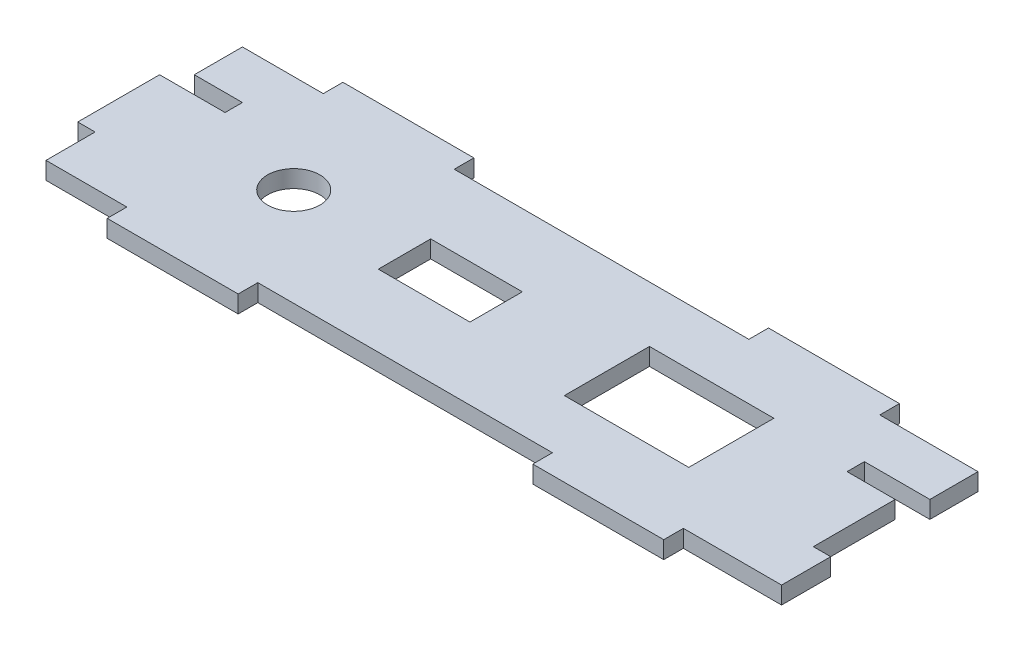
ISO-10303-21;
HEADER;
FILE_DESCRIPTION(('STEP AP214'),'2;1');
FILE_NAME('part.step','',(''),(''),'','','');
FILE_SCHEMA(('AUTOMOTIVE_DESIGN { 1 0 10303 214 1 1 1 1 }'));
ENDSEC;
DATA;
#1=APPLICATION_CONTEXT('core data for automotive mechanical design processes');
#2=APPLICATION_PROTOCOL_DEFINITION('international standard','automotive_design',2000,#1);
#3=PRODUCT_CONTEXT('',#1,'mechanical');
#4=PRODUCT('Part','Part','',(#3));
#5=PRODUCT_RELATED_PRODUCT_CATEGORY('part','',(#4));
#6=PRODUCT_DEFINITION_FORMATION('','',#4);
#7=PRODUCT_DEFINITION_CONTEXT('part definition',#1,'design');
#8=PRODUCT_DEFINITION('design','',#6,#7);
#9=PRODUCT_DEFINITION_SHAPE('','',#8);
#10=(LENGTH_UNIT() NAMED_UNIT(*) SI_UNIT(.MILLI.,.METRE.));
#11=(NAMED_UNIT(*) PLANE_ANGLE_UNIT() SI_UNIT($,.RADIAN.));
#12=(NAMED_UNIT(*) SI_UNIT($,.STERADIAN.) SOLID_ANGLE_UNIT());
#13=UNCERTAINTY_MEASURE_WITH_UNIT(LENGTH_MEASURE(1.E-05),#10,'distance_accuracy_value','');
#14=(GEOMETRIC_REPRESENTATION_CONTEXT(3) GLOBAL_UNCERTAINTY_ASSIGNED_CONTEXT((#13)) GLOBAL_UNIT_ASSIGNED_CONTEXT((#10,
#11,#12)) REPRESENTATION_CONTEXT('',''));
#15=CARTESIAN_POINT('',(0.,0.,0.));
#16=DIRECTION('',(0.,0.,1.));
#17=DIRECTION('',(1.,0.,0.));
#18=AXIS2_PLACEMENT_3D('',#15,#16,#17);
#19=CARTESIAN_POINT('',(0.,0.,30.));
#20=DIRECTION('',(0.,0.,1.));
#21=DIRECTION('',(1.,0.,0.));
#22=AXIS2_PLACEMENT_3D('',#19,#20,#21);
#23=PLANE('',#22);
#24=DIRECTION('',(0.,1.,0.));
#25=VECTOR('',#24,1.);
#26=CARTESIAN_POINT('',(85.,120.,30.));
#27=LINE('',#26,#25);
#28=CARTESIAN_POINT('',(85.,117.35,30.));
#29=VERTEX_POINT('',#28);
#30=CARTESIAN_POINT('',(85.,120.,30.));
#31=VERTEX_POINT('',#30);
#32=EDGE_CURVE('E407',#29,#31,#27,.T.);
#33=ORIENTED_EDGE('',*,*,#32,.T.);
#34=DIRECTION('',(-1.,0.,0.));
#35=VECTOR('',#34,1.);
#36=CARTESIAN_POINT('',(4.99999999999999,120.,30.));
#37=LINE('',#36,#35);
#38=CARTESIAN_POINT('',(40.,120.,30.));
#39=VERTEX_POINT('',#38);
#40=EDGE_CURVE('E565',#31,#39,#37,.T.);
#41=ORIENTED_EDGE('',*,*,#40,.T.);
#42=DIRECTION('',(0.,-1.,0.));
#43=VECTOR('',#42,1.);
#44=CARTESIAN_POINT('',(40.,120.,30.));
#45=LINE('',#44,#43);
#46=CARTESIAN_POINT('',(40.,117.35,30.));
#47=VERTEX_POINT('',#46);
#48=EDGE_CURVE('E441',#39,#47,#45,.T.);
#49=ORIENTED_EDGE('',*,*,#48,.T.);
#50=DIRECTION('',(1.,0.,0.));
#51=VECTOR('',#50,1.);
#52=CARTESIAN_POINT('',(4.99999999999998,117.35,30.));
#53=LINE('',#52,#51);
#54=EDGE_CURVE('E558',#47,#29,#53,.T.);
#55=ORIENTED_EDGE('',*,*,#54,.T.);
#56=EDGE_LOOP('',(#33,#41,#49,#55));
#57=FACE_BOUND('',#56,.T.);
#58=ADVANCED_FACE('F33',(#57),#23,.T.);
#59=CARTESIAN_POINT('',(7.64999999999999,117.35,30.));
#60=VERTEX_POINT('',#59);
#61=CARTESIAN_POINT('',(19.9999999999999,117.35,30.));
#62=VERTEX_POINT('',#61);
#63=EDGE_CURVE('E554',#60,#62,#53,.T.);
#64=ORIENTED_EDGE('',*,*,#63,.T.);
#65=DIRECTION('',(0.,1.,0.));
#66=VECTOR('',#65,1.);
#67=CARTESIAN_POINT('',(20.,120.,30.));
#68=LINE('',#67,#66);
#69=CARTESIAN_POINT('',(20.,120.,30.));
#70=VERTEX_POINT('',#69);
#71=EDGE_CURVE('E436',#62,#70,#68,.T.);
#72=ORIENTED_EDGE('',*,*,#71,.T.);
#73=CARTESIAN_POINT('',(7.64999999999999,120.,30.));
#74=VERTEX_POINT('',#73);
#75=EDGE_CURVE('E561',#70,#74,#37,.T.);
#76=ORIENTED_EDGE('',*,*,#75,.T.);
#77=DIRECTION('',(0.,1.,0.));
#78=VECTOR('',#77,1.);
#79=CARTESIAN_POINT('',(7.64999999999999,102.117715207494,30.));
#80=LINE('',#79,#78);
#81=EDGE_CURVE('E490',#60,#74,#80,.T.);
#82=ORIENTED_EDGE('',*,*,#81,.F.);
#83=EDGE_LOOP('',(#64,#72,#76,#82));
#84=FACE_BOUND('',#83,.T.);
#85=ADVANCED_FACE('F698',(#84),#23,.T.);
#86=DIRECTION('',(0.,-1.,0.));
#87=VECTOR('',#86,1.);
#88=CARTESIAN_POINT('',(105.,120.,30.));
#89=LINE('',#88,#87);
#90=CARTESIAN_POINT('',(105.,120.,30.));
#91=VERTEX_POINT('',#90);
#92=CARTESIAN_POINT('',(105.,117.35,30.));
#93=VERTEX_POINT('',#92);
#94=EDGE_CURVE('E412',#91,#93,#89,.T.);
#95=ORIENTED_EDGE('',*,*,#94,.T.);
#96=CARTESIAN_POINT('',(120.,117.35,30.));
#97=VERTEX_POINT('',#96);
#98=EDGE_CURVE('E559',#93,#97,#53,.T.);
#99=ORIENTED_EDGE('',*,*,#98,.T.);
#100=DIRECTION('',(0.,1.,0.));
#101=VECTOR('',#100,1.);
#102=CARTESIAN_POINT('',(120.,120.,30.));
#103=LINE('',#102,#101);
#104=CARTESIAN_POINT('',(120.,120.,30.));
#105=VERTEX_POINT('',#104);
#106=EDGE_CURVE('E557',#97,#105,#103,.T.);
#107=ORIENTED_EDGE('',*,*,#106,.T.);
#108=EDGE_CURVE('E562',#105,#91,#37,.T.);
#109=ORIENTED_EDGE('',*,*,#108,.T.);
#110=EDGE_LOOP('',(#95,#99,#107,#109));
#111=FACE_BOUND('',#110,.T.);
#112=ADVANCED_FACE('F726',(#111),#23,.T.);
#113=CARTESIAN_POINT('',(120.,120.,30.));
#114=DIRECTION('',(-1.,0.,0.));
#115=DIRECTION('',(0.,0.,1.));
#116=AXIS2_PLACEMENT_3D('',#113,#114,#115);
#117=PLANE('',#116);
#118=DIRECTION('',(0.,0.,-1.));
#119=VECTOR('',#118,1.);
#120=CARTESIAN_POINT('',(120.,117.35,30.));
#121=LINE('',#120,#119);
#122=CARTESIAN_POINT('',(120.,117.35,22.5));
#123=VERTEX_POINT('',#122);
#124=EDGE_CURVE('E584',#97,#123,#121,.T.);
#125=ORIENTED_EDGE('',*,*,#124,.T.);
#126=DIRECTION('',(0.,1.,0.));
#127=VECTOR('',#126,1.);
#128=CARTESIAN_POINT('',(120.,102.117715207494,22.5));
#129=LINE('',#128,#127);
#130=CARTESIAN_POINT('',(120.,120.,22.5));
#131=VERTEX_POINT('',#130);
#132=EDGE_CURVE('E468',#123,#131,#129,.T.);
#133=ORIENTED_EDGE('',*,*,#132,.T.);
#134=DIRECTION('',(0.,0.,-1.));
#135=VECTOR('',#134,1.);
#136=CARTESIAN_POINT('',(120.,120.,30.));
#137=LINE('',#136,#135);
#138=EDGE_CURVE('E580',#105,#131,#137,.T.);
#139=ORIENTED_EDGE('',*,*,#138,.F.);
#140=ORIENTED_EDGE('',*,*,#106,.F.);
#141=EDGE_LOOP('',(#125,#133,#139,#140));
#142=FACE_BOUND('',#141,.T.);
#143=ADVANCED_FACE('F608',(#142),#117,.F.);
#144=CARTESIAN_POINT('',(0.,0.,0.));
#145=DIRECTION('',(0.,0.,1.));
#146=DIRECTION('',(1.,0.,0.));
#147=AXIS2_PLACEMENT_3D('',#144,#145,#146);
#148=PLANE('',#147);
#149=DIRECTION('',(0.,-1.,0.));
#150=VECTOR('',#149,1.);
#151=CARTESIAN_POINT('',(105.,120.,0.));
#152=LINE('',#151,#150);
#153=CARTESIAN_POINT('',(105.,120.,0.));
#154=VERTEX_POINT('',#153);
#155=CARTESIAN_POINT('',(105.,117.35,0.));
#156=VERTEX_POINT('',#155);
#157=EDGE_CURVE('E470',#154,#156,#152,.T.);
#158=ORIENTED_EDGE('',*,*,#157,.F.);
#159=DIRECTION('',(-1.,0.,0.));
#160=VECTOR('',#159,1.);
#161=CARTESIAN_POINT('',(4.99999999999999,120.,0.));
#162=LINE('',#161,#160);
#163=CARTESIAN_POINT('',(120.,120.,0.));
#164=VERTEX_POINT('',#163);
#165=EDGE_CURVE('E573',#164,#154,#162,.T.);
#166=ORIENTED_EDGE('',*,*,#165,.F.);
#167=DIRECTION('',(0.,1.,0.));
#168=VECTOR('',#167,1.);
#169=CARTESIAN_POINT('',(120.,120.,0.));
#170=LINE('',#169,#168);
#171=CARTESIAN_POINT('',(120.,117.35,0.));
#172=VERTEX_POINT('',#171);
#173=EDGE_CURVE('E568',#172,#164,#170,.T.);
#174=ORIENTED_EDGE('',*,*,#173,.F.);
#175=DIRECTION('',(1.,0.,0.));
#176=VECTOR('',#175,1.);
#177=CARTESIAN_POINT('',(4.99999999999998,117.35,0.));
#178=LINE('',#177,#176);
#179=EDGE_CURVE('E553',#156,#172,#178,.T.);
#180=ORIENTED_EDGE('',*,*,#179,.F.);
#181=EDGE_LOOP('',(#158,#166,#174,#180));
#182=FACE_BOUND('',#181,.T.);
#183=ADVANCED_FACE('F631',(#182),#148,.F.);
#184=DIRECTION('',(0.,1.,0.));
#185=VECTOR('',#184,1.);
#186=CARTESIAN_POINT('',(85.,120.,0.));
#187=LINE('',#186,#185);
#188=CARTESIAN_POINT('',(85.,117.35,0.));
#189=VERTEX_POINT('',#188);
#190=CARTESIAN_POINT('',(85.,120.,0.));
#191=VERTEX_POINT('',#190);
#192=EDGE_CURVE('E508',#189,#191,#187,.T.);
#193=ORIENTED_EDGE('',*,*,#192,.F.);
#194=CARTESIAN_POINT('',(39.9999999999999,117.35,0.));
#195=VERTEX_POINT('',#194);
#196=EDGE_CURVE('E569',#195,#189,#178,.T.);
#197=ORIENTED_EDGE('',*,*,#196,.F.);
#198=DIRECTION('',(0.,-1.,0.));
#199=VECTOR('',#198,1.);
#200=CARTESIAN_POINT('',(40.,120.,0.));
#201=LINE('',#200,#199);
#202=CARTESIAN_POINT('',(40.,120.,0.));
#203=VERTEX_POINT('',#202);
#204=EDGE_CURVE('E531',#203,#195,#201,.T.);
#205=ORIENTED_EDGE('',*,*,#204,.F.);
#206=EDGE_CURVE('E576',#191,#203,#162,.T.);
#207=ORIENTED_EDGE('',*,*,#206,.F.);
#208=EDGE_LOOP('',(#193,#197,#205,#207));
#209=FACE_BOUND('',#208,.T.);
#210=ADVANCED_FACE('F651',(#209),#148,.F.);
#211=CARTESIAN_POINT('',(7.64999999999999,117.35,0.));
#212=VERTEX_POINT('',#211);
#213=CARTESIAN_POINT('',(20.,117.35,0.));
#214=VERTEX_POINT('',#213);
#215=EDGE_CURVE('E566',#212,#214,#178,.T.);
#216=ORIENTED_EDGE('',*,*,#215,.F.);
#217=DIRECTION('',(0.,1.,0.));
#218=VECTOR('',#217,1.);
#219=CARTESIAN_POINT('',(7.65,102.117715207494,0.));
#220=LINE('',#219,#218);
#221=CARTESIAN_POINT('',(7.64999999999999,120.,0.));
#222=VERTEX_POINT('',#221);
#223=EDGE_CURVE('E500',#212,#222,#220,.T.);
#224=ORIENTED_EDGE('',*,*,#223,.T.);
#225=CARTESIAN_POINT('',(20.,120.,0.));
#226=VERTEX_POINT('',#225);
#227=EDGE_CURVE('E572',#226,#222,#162,.T.);
#228=ORIENTED_EDGE('',*,*,#227,.F.);
#229=DIRECTION('',(0.,1.,0.));
#230=VECTOR('',#229,1.);
#231=CARTESIAN_POINT('',(20.,120.,0.));
#232=LINE('',#231,#230);
#233=EDGE_CURVE('E526',#214,#226,#232,.T.);
#234=ORIENTED_EDGE('',*,*,#233,.F.);
#235=EDGE_LOOP('',(#216,#224,#228,#234));
#236=FACE_BOUND('',#235,.T.);
#237=ADVANCED_FACE('F668',(#236),#148,.F.);
#238=CARTESIAN_POINT('',(4.99999999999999,120.,30.));
#239=DIRECTION('',(1.,0.,0.));
#240=DIRECTION('',(0.,1.,0.));
#241=AXIS2_PLACEMENT_3D('',#238,#239,#240);
#242=PLANE('',#241);
#243=DIRECTION('',(0.,0.,-1.));
#244=VECTOR('',#243,1.);
#245=CARTESIAN_POINT('',(4.99999999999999,120.,30.));
#246=LINE('',#245,#244);
#247=CARTESIAN_POINT('',(4.99999999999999,120.,22.5));
#248=VERTEX_POINT('',#247);
#249=CARTESIAN_POINT('',(4.99999999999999,120.,10.));
#250=VERTEX_POINT('',#249);
#251=EDGE_CURVE('E564',#248,#250,#246,.T.);
#252=ORIENTED_EDGE('',*,*,#251,.T.);
#253=DIRECTION('',(0.,1.,0.));
#254=VECTOR('',#253,1.);
#255=CARTESIAN_POINT('',(4.99999999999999,117.,10.));
#256=LINE('',#255,#254);
#257=CARTESIAN_POINT('',(4.99999999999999,117.35,10.));
#258=VERTEX_POINT('',#257);
#259=EDGE_CURVE('E371',#258,#250,#256,.T.);
#260=ORIENTED_EDGE('',*,*,#259,.F.);
#261=DIRECTION('',(0.,0.,-1.));
#262=VECTOR('',#261,1.);
#263=CARTESIAN_POINT('',(4.99999999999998,117.35,30.));
#264=LINE('',#263,#262);
#265=CARTESIAN_POINT('',(4.99999999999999,117.35,22.5));
#266=VERTEX_POINT('',#265);
#267=EDGE_CURVE('E587',#266,#258,#264,.T.);
#268=ORIENTED_EDGE('',*,*,#267,.F.);
#269=DIRECTION('',(0.,1.,0.));
#270=VECTOR('',#269,1.);
#271=CARTESIAN_POINT('',(4.99999999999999,102.117715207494,22.5));
#272=LINE('',#271,#270);
#273=EDGE_CURVE('E483',#266,#248,#272,.T.);
#274=ORIENTED_EDGE('',*,*,#273,.T.);
#275=EDGE_LOOP('',(#252,#260,#268,#274));
#276=FACE_BOUND('',#275,.T.);
#277=ADVANCED_FACE('F35',(#276),#242,.F.);
#278=CARTESIAN_POINT('',(4.99999999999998,117.35,30.));
#279=DIRECTION('',(0.,1.,0.));
#280=DIRECTION('',(0.,0.,1.));
#281=AXIS2_PLACEMENT_3D('',#278,#279,#280);
#282=PLANE('',#281);
#283=DIRECTION('',(1.,0.,0.));
#284=VECTOR('',#283,1.);
#285=CARTESIAN_POINT('',(61.4182559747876,117.35,11.0142598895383));
#286=LINE('',#285,#284);
#287=CARTESIAN_POINT('',(47.4182559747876,117.35,11.0142598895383));
#288=VERTEX_POINT('',#287);
#289=CARTESIAN_POINT('',(61.4182559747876,117.35,11.0142598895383));
#290=VERTEX_POINT('',#289);
#291=EDGE_CURVE('E310',#288,#290,#286,.T.);
#292=ORIENTED_EDGE('',*,*,#291,.F.);
#293=DIRECTION('',(0.,0.,-1.));
#294=VECTOR('',#293,1.);
#295=CARTESIAN_POINT('',(47.4182559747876,117.35,19.0142598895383));
#296=LINE('',#295,#294);
#297=CARTESIAN_POINT('',(47.4182559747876,117.35,19.0142598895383));
#298=VERTEX_POINT('',#297);
#299=EDGE_CURVE('E292',#298,#288,#296,.T.);
#300=ORIENTED_EDGE('',*,*,#299,.F.);
#301=DIRECTION('',(-1.,0.,0.));
#302=VECTOR('',#301,1.);
#303=CARTESIAN_POINT('',(61.4182559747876,117.35,19.0142598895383));
#304=LINE('',#303,#302);
#305=CARTESIAN_POINT('',(61.4182559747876,117.35,19.0142598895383));
#306=VERTEX_POINT('',#305);
#307=EDGE_CURVE('E301',#306,#298,#304,.T.);
#308=ORIENTED_EDGE('',*,*,#307,.F.);
#309=DIRECTION('',(0.,0.,1.));
#310=VECTOR('',#309,1.);
#311=CARTESIAN_POINT('',(61.4182559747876,117.35,19.0142598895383));
#312=LINE('',#311,#310);
#313=EDGE_CURVE('E48',#290,#306,#312,.T.);
#314=ORIENTED_EDGE('',*,*,#313,.F.);
#315=EDGE_LOOP('',(#292,#300,#308,#314));
#316=FACE_BOUND('',#315,.T.);
#317=CARTESIAN_POINT('',(30.4865119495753,117.35,14.9999999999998));
#318=DIRECTION('',(0.,1.,0.));
#319=DIRECTION('',(0.,0.,1.));
#320=AXIS2_PLACEMENT_3D('',#317,#318,#319);
#321=CIRCLE('',#320,4.00000000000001);
#322=CARTESIAN_POINT('',(30.4865119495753,117.35,18.9999999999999));
#323=VERTEX_POINT('',#322);
#324=EDGE_CURVE('E329',#323,#323,#321,.F.);
#325=ORIENTED_EDGE('',*,*,#324,.F.);
#326=EDGE_LOOP('',(#325));
#327=FACE_BOUND('',#326,.T.);
#328=DIRECTION('',(1.,0.,0.));
#329=VECTOR('',#328,1.);
#330=CARTESIAN_POINT('',(78.35,117.35,8.52851977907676));
#331=LINE('',#330,#329);
#332=CARTESIAN_POINT('',(78.35,117.35,8.52851977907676));
#333=VERTEX_POINT('',#332);
#334=CARTESIAN_POINT('',(97.35,117.35,8.52851977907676));
#335=VERTEX_POINT('',#334);
#336=EDGE_CURVE('E336',#333,#335,#331,.T.);
#337=ORIENTED_EDGE('',*,*,#336,.F.);
#338=DIRECTION('',(0.,0.,-1.));
#339=VECTOR('',#338,1.);
#340=CARTESIAN_POINT('',(78.35,117.35,8.52851977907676));
#341=LINE('',#340,#339);
#342=CARTESIAN_POINT('',(78.35,117.35,21.5285197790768));
#343=VERTEX_POINT('',#342);
#344=EDGE_CURVE('E339',#343,#333,#341,.T.);
#345=ORIENTED_EDGE('',*,*,#344,.F.);
#346=DIRECTION('',(-1.,0.,0.));
#347=VECTOR('',#346,1.);
#348=CARTESIAN_POINT('',(78.35,117.35,21.5285197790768));
#349=LINE('',#348,#347);
#350=CARTESIAN_POINT('',(97.35,117.35,21.5285197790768));
#351=VERTEX_POINT('',#350);
#352=EDGE_CURVE('E341',#351,#343,#349,.T.);
#353=ORIENTED_EDGE('',*,*,#352,.F.);
#354=DIRECTION('',(0.,0.,1.));
#355=VECTOR('',#354,1.);
#356=CARTESIAN_POINT('',(97.35,117.35,8.52851977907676));
#357=LINE('',#356,#355);
#358=EDGE_CURVE('E333',#335,#351,#357,.T.);
#359=ORIENTED_EDGE('',*,*,#358,.F.);
#360=EDGE_LOOP('',(#337,#345,#353,#359));
#361=FACE_BOUND('',#360,.T.);
#362=DIRECTION('',(0.,0.,-1.));
#363=VECTOR('',#362,1.);
#364=CARTESIAN_POINT('',(15.,117.35,30.));
#365=LINE('',#364,#363);
#366=CARTESIAN_POINT('',(15.,117.35,10.));
#367=VERTEX_POINT('',#366);
#368=CARTESIAN_POINT('',(15.,117.35,7.35));
#369=VERTEX_POINT('',#368);
#370=EDGE_CURVE('E404',#367,#369,#365,.T.);
#371=ORIENTED_EDGE('',*,*,#370,.T.);
#372=DIRECTION('',(-1.,0.,0.));
#373=VECTOR('',#372,1.);
#374=CARTESIAN_POINT('',(4.99999999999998,117.35,7.35));
#375=LINE('',#374,#373);
#376=CARTESIAN_POINT('',(7.64999999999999,117.35,7.35));
#377=VERTEX_POINT('',#376);
#378=EDGE_CURVE('E392',#369,#377,#375,.T.);
#379=ORIENTED_EDGE('',*,*,#378,.T.);
#380=DIRECTION('',(0.,0.,1.));
#381=VECTOR('',#380,1.);
#382=CARTESIAN_POINT('',(7.64999999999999,117.35,7.50000000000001));
#383=LINE('',#382,#381);
#384=EDGE_CURVE('E488',#212,#377,#383,.T.);
#385=ORIENTED_EDGE('',*,*,#384,.F.);
#386=ORIENTED_EDGE('',*,*,#215,.T.);
#387=DIRECTION('',(0.,0.,1.));
#388=VECTOR('',#387,1.);
#389=CARTESIAN_POINT('',(19.9999999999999,117.35,-3.));
#390=LINE('',#389,#388);
#391=CARTESIAN_POINT('',(19.9999999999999,117.35,-3.));
#392=VERTEX_POINT('',#391);
#393=EDGE_CURVE('E537',#392,#214,#390,.T.);
#394=ORIENTED_EDGE('',*,*,#393,.F.);
#395=DIRECTION('',(-1.,0.,0.));
#396=VECTOR('',#395,1.);
#397=CARTESIAN_POINT('',(19.9999999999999,117.35,-3.));
#398=LINE('',#397,#396);
#399=CARTESIAN_POINT('',(39.9999999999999,117.35,-3.));
#400=VERTEX_POINT('',#399);
#401=EDGE_CURVE('E535',#400,#392,#398,.T.);
#402=ORIENTED_EDGE('',*,*,#401,.F.);
#403=DIRECTION('',(0.,0.,1.));
#404=VECTOR('',#403,1.);
#405=CARTESIAN_POINT('',(39.9999999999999,117.35,-3.));
#406=LINE('',#405,#404);
#407=EDGE_CURVE('E544',#400,#195,#406,.T.);
#408=ORIENTED_EDGE('',*,*,#407,.T.);
#409=ORIENTED_EDGE('',*,*,#196,.T.);
#410=DIRECTION('',(0.,0.,1.));
#411=VECTOR('',#410,1.);
#412=CARTESIAN_POINT('',(85.,117.35,-3.));
#413=LINE('',#412,#411);
#414=CARTESIAN_POINT('',(85.,117.35,-3.));
#415=VERTEX_POINT('',#414);
#416=EDGE_CURVE('E519',#415,#189,#413,.T.);
#417=ORIENTED_EDGE('',*,*,#416,.F.);
#418=DIRECTION('',(-1.,0.,0.));
#419=VECTOR('',#418,1.);
#420=CARTESIAN_POINT('',(105.,117.35,-3.));
#421=LINE('',#420,#419);
#422=CARTESIAN_POINT('',(105.,117.35,-3.));
#423=VERTEX_POINT('',#422);
#424=EDGE_CURVE('E510',#423,#415,#421,.T.);
#425=ORIENTED_EDGE('',*,*,#424,.F.);
#426=DIRECTION('',(0.,0.,1.));
#427=VECTOR('',#426,1.);
#428=CARTESIAN_POINT('',(105.,117.35,-3.));
#429=LINE('',#428,#427);
#430=EDGE_CURVE('E521',#423,#156,#429,.T.);
#431=ORIENTED_EDGE('',*,*,#430,.T.);
#432=ORIENTED_EDGE('',*,*,#179,.T.);
#433=CARTESIAN_POINT('',(120.,117.35,7.34999999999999));
#434=VERTEX_POINT('',#433);
#435=EDGE_CURVE('E583',#434,#172,#121,.T.);
#436=ORIENTED_EDGE('',*,*,#435,.F.);
#437=DIRECTION('',(-1.,0.,0.));
#438=VECTOR('',#437,1.);
#439=CARTESIAN_POINT('',(4.99999999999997,117.35,7.35000000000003));
#440=LINE('',#439,#438);
#441=CARTESIAN_POINT('',(110.,117.35,7.34999999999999));
#442=VERTEX_POINT('',#441);
#443=EDGE_CURVE('E398',#434,#442,#440,.T.);
#444=ORIENTED_EDGE('',*,*,#443,.T.);
#445=DIRECTION('',(0.,0.,1.));
#446=VECTOR('',#445,1.);
#447=CARTESIAN_POINT('',(110.,117.35,30.));
#448=LINE('',#447,#446);
#449=CARTESIAN_POINT('',(110.,117.35,9.99999999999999));
#450=VERTEX_POINT('',#449);
#451=EDGE_CURVE('E395',#442,#450,#448,.T.);
#452=ORIENTED_EDGE('',*,*,#451,.T.);
#453=DIRECTION('',(1.,0.,0.));
#454=VECTOR('',#453,1.);
#455=CARTESIAN_POINT('',(4.99999999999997,117.35,10.));
#456=LINE('',#455,#454);
#457=CARTESIAN_POINT('',(117.35,117.35,9.99999999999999));
#458=VERTEX_POINT('',#457);
#459=EDGE_CURVE('E374',#450,#458,#456,.T.);
#460=ORIENTED_EDGE('',*,*,#459,.T.);
#461=DIRECTION('',(0.,0.,-1.));
#462=VECTOR('',#461,1.);
#463=CARTESIAN_POINT('',(117.35,117.35,7.5));
#464=LINE('',#463,#462);
#465=CARTESIAN_POINT('',(117.35,117.35,22.5));
#466=VERTEX_POINT('',#465);
#467=EDGE_CURVE('E464',#466,#458,#464,.T.);
#468=ORIENTED_EDGE('',*,*,#467,.F.);
#469=DIRECTION('',(-1.,0.,0.));
#470=VECTOR('',#469,1.);
#471=CARTESIAN_POINT('',(120.,117.35,22.5));
#472=LINE('',#471,#470);
#473=EDGE_CURVE('E467',#123,#466,#472,.T.);
#474=ORIENTED_EDGE('',*,*,#473,.F.);
#475=ORIENTED_EDGE('',*,*,#124,.F.);
#476=ORIENTED_EDGE('',*,*,#98,.F.);
#477=DIRECTION('',(0.,0.,-1.));
#478=VECTOR('',#477,1.);
#479=CARTESIAN_POINT('',(105.,117.35,33.));
#480=LINE('',#479,#478);
#481=CARTESIAN_POINT('',(105.,117.35,33.));
#482=VERTEX_POINT('',#481);
#483=EDGE_CURVE('E427',#482,#93,#480,.T.);
#484=ORIENTED_EDGE('',*,*,#483,.F.);
#485=DIRECTION('',(-1.,0.,0.));
#486=VECTOR('',#485,1.);
#487=CARTESIAN_POINT('',(105.,117.35,33.));
#488=LINE('',#487,#486);
#489=CARTESIAN_POINT('',(85.,117.35,33.));
#490=VERTEX_POINT('',#489);
#491=EDGE_CURVE('E415',#482,#490,#488,.T.);
#492=ORIENTED_EDGE('',*,*,#491,.T.);
#493=DIRECTION('',(0.,0.,-1.));
#494=VECTOR('',#493,1.);
#495=CARTESIAN_POINT('',(85.,117.35,33.));
#496=LINE('',#495,#494);
#497=EDGE_CURVE('E430',#490,#29,#496,.T.);
#498=ORIENTED_EDGE('',*,*,#497,.T.);
#499=ORIENTED_EDGE('',*,*,#54,.F.);
#500=DIRECTION('',(0.,0.,-1.));
#501=VECTOR('',#500,1.);
#502=CARTESIAN_POINT('',(39.9999999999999,117.35,33.));
#503=LINE('',#502,#501);
#504=CARTESIAN_POINT('',(39.9999999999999,117.35,33.));
#505=VERTEX_POINT('',#504);
#506=EDGE_CURVE('E459',#505,#47,#503,.T.);
#507=ORIENTED_EDGE('',*,*,#506,.F.);
#508=DIRECTION('',(-1.,0.,0.));
#509=VECTOR('',#508,1.);
#510=CARTESIAN_POINT('',(19.9999999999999,117.35,33.));
#511=LINE('',#510,#509);
#512=CARTESIAN_POINT('',(19.9999999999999,117.35,33.));
#513=VERTEX_POINT('',#512);
#514=EDGE_CURVE('E440',#505,#513,#511,.T.);
#515=ORIENTED_EDGE('',*,*,#514,.T.);
#516=DIRECTION('',(0.,0.,-1.));
#517=VECTOR('',#516,1.);
#518=CARTESIAN_POINT('',(19.9999999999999,117.35,33.));
#519=LINE('',#518,#517);
#520=EDGE_CURVE('E461',#513,#62,#519,.T.);
#521=ORIENTED_EDGE('',*,*,#520,.T.);
#522=ORIENTED_EDGE('',*,*,#63,.F.);
#523=DIRECTION('',(0.,0.,1.));
#524=VECTOR('',#523,1.);
#525=CARTESIAN_POINT('',(7.64999999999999,117.35,30.));
#526=LINE('',#525,#524);
#527=CARTESIAN_POINT('',(7.64999999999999,117.35,22.5));
#528=VERTEX_POINT('',#527);
#529=EDGE_CURVE('E474',#528,#60,#526,.T.);
#530=ORIENTED_EDGE('',*,*,#529,.F.);
#531=DIRECTION('',(1.,0.,0.));
#532=VECTOR('',#531,1.);
#533=CARTESIAN_POINT('',(7.64999999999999,117.35,22.5));
#534=LINE('',#533,#532);
#535=EDGE_CURVE('E481',#266,#528,#534,.T.);
#536=ORIENTED_EDGE('',*,*,#535,.F.);
#537=ORIENTED_EDGE('',*,*,#267,.T.);
#538=DIRECTION('',(1.,0.,0.));
#539=VECTOR('',#538,1.);
#540=CARTESIAN_POINT('',(4.99999999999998,117.35,10.));
#541=LINE('',#540,#539);
#542=EDGE_CURVE('E401',#258,#367,#541,.T.);
#543=ORIENTED_EDGE('',*,*,#542,.T.);
#544=EDGE_LOOP('',(#371,#379,#385,#386,#394,#402,#408,#409,#417,#425,#431,#432,#436,#444,#452,
#460,#468,#474,#475,#476,#484,#492,#498,#499,#507,#515,#521,#522,#530,#536,#537,#543));
#545=FACE_BOUND('',#544,.T.);
#546=ADVANCED_FACE('F307',(#316,#327,#361,#545),#282,.F.);
#547=CARTESIAN_POINT('',(120.,120.,7.34999999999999));
#548=VERTEX_POINT('',#547);
#549=EDGE_CURVE('E579',#548,#164,#137,.T.);
#550=ORIENTED_EDGE('',*,*,#549,.F.);
#551=DIRECTION('',(0.,1.,0.));
#552=VECTOR('',#551,1.);
#553=CARTESIAN_POINT('',(120.,117.,7.34999999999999));
#554=LINE('',#553,#552);
#555=EDGE_CURVE('E366',#434,#548,#554,.T.);
#556=ORIENTED_EDGE('',*,*,#555,.F.);
#557=ORIENTED_EDGE('',*,*,#435,.T.);
#558=ORIENTED_EDGE('',*,*,#173,.T.);
#559=EDGE_LOOP('',(#550,#556,#557,#558));
#560=FACE_BOUND('',#559,.T.);
#561=ADVANCED_FACE('F623',(#560),#117,.F.);
#562=CARTESIAN_POINT('',(4.99999999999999,120.,30.));
#563=DIRECTION('',(0.,-1.,0.));
#564=DIRECTION('',(1.,0.,0.));
#565=AXIS2_PLACEMENT_3D('',#562,#563,#564);
#566=PLANE('',#565);
#567=DIRECTION('',(1.,0.,0.));
#568=VECTOR('',#567,1.);
#569=CARTESIAN_POINT('',(61.4182559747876,120.,19.0142598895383));
#570=LINE('',#569,#568);
#571=CARTESIAN_POINT('',(47.4182559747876,120.,19.0142598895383));
#572=VERTEX_POINT('',#571);
#573=CARTESIAN_POINT('',(61.4182559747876,120.,19.0142598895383));
#574=VERTEX_POINT('',#573);
#575=EDGE_CURVE('E312',#572,#574,#570,.T.);
#576=ORIENTED_EDGE('',*,*,#575,.F.);
#577=DIRECTION('',(0.,0.,1.));
#578=VECTOR('',#577,1.);
#579=CARTESIAN_POINT('',(47.4182559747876,120.,19.0142598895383));
#580=LINE('',#579,#578);
#581=CARTESIAN_POINT('',(47.4182559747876,120.,11.0142598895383));
#582=VERTEX_POINT('',#581);
#583=EDGE_CURVE('E56',#582,#572,#580,.T.);
#584=ORIENTED_EDGE('',*,*,#583,.F.);
#585=DIRECTION('',(-1.,0.,0.));
#586=VECTOR('',#585,1.);
#587=CARTESIAN_POINT('',(61.4182559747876,120.,11.0142598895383));
#588=LINE('',#587,#586);
#589=CARTESIAN_POINT('',(61.4182559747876,120.,11.0142598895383));
#590=VERTEX_POINT('',#589);
#591=EDGE_CURVE('E298',#590,#582,#588,.T.);
#592=ORIENTED_EDGE('',*,*,#591,.F.);
#593=DIRECTION('',(0.,0.,-1.));
#594=VECTOR('',#593,1.);
#595=CARTESIAN_POINT('',(61.4182559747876,120.,19.0142598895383));
#596=LINE('',#595,#594);
#597=EDGE_CURVE('E318',#574,#590,#596,.T.);
#598=ORIENTED_EDGE('',*,*,#597,.F.);
#599=EDGE_LOOP('',(#576,#584,#592,#598));
#600=FACE_BOUND('',#599,.T.);
#601=CARTESIAN_POINT('',(30.4865119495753,120.,14.9999999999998));
#602=DIRECTION('',(0.,1.,0.));
#603=DIRECTION('',(-1.,0.,0.));
#604=AXIS2_PLACEMENT_3D('',#601,#602,#603);
#605=CIRCLE('',#604,4.00000000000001);
#606=CARTESIAN_POINT('',(26.4865119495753,120.,14.9999999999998));
#607=VERTEX_POINT('',#606);
#608=EDGE_CURVE('E304',#607,#607,#605,.T.);
#609=ORIENTED_EDGE('',*,*,#608,.F.);
#610=EDGE_LOOP('',(#609));
#611=FACE_BOUND('',#610,.T.);
#612=DIRECTION('',(1.,0.,0.));
#613=VECTOR('',#612,1.);
#614=CARTESIAN_POINT('',(78.35,120.,21.5285197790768));
#615=LINE('',#614,#613);
#616=CARTESIAN_POINT('',(78.35,120.,21.5285197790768));
#617=VERTEX_POINT('',#616);
#618=CARTESIAN_POINT('',(97.35,120.,21.5285197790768));
#619=VERTEX_POINT('',#618);
#620=EDGE_CURVE('E343',#617,#619,#615,.T.);
#621=ORIENTED_EDGE('',*,*,#620,.F.);
#622=DIRECTION('',(0.,0.,1.));
#623=VECTOR('',#622,1.);
#624=CARTESIAN_POINT('',(78.35,120.,8.52851977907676));
#625=LINE('',#624,#623);
#626=CARTESIAN_POINT('',(78.35,120.,8.52851977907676));
#627=VERTEX_POINT('',#626);
#628=EDGE_CURVE('E332',#627,#617,#625,.T.);
#629=ORIENTED_EDGE('',*,*,#628,.F.);
#630=DIRECTION('',(-1.,0.,0.));
#631=VECTOR('',#630,1.);
#632=CARTESIAN_POINT('',(78.35,120.,8.52851977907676));
#633=LINE('',#632,#631);
#634=CARTESIAN_POINT('',(97.35,120.,8.52851977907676));
#635=VERTEX_POINT('',#634);
#636=EDGE_CURVE('E349',#635,#627,#633,.T.);
#637=ORIENTED_EDGE('',*,*,#636,.F.);
#638=DIRECTION('',(0.,0.,-1.));
#639=VECTOR('',#638,1.);
#640=CARTESIAN_POINT('',(97.35,120.,8.52851977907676));
#641=LINE('',#640,#639);
#642=EDGE_CURVE('E346',#619,#635,#641,.T.);
#643=ORIENTED_EDGE('',*,*,#642,.F.);
#644=EDGE_LOOP('',(#621,#629,#637,#643));
#645=FACE_BOUND('',#644,.T.);
#646=DIRECTION('',(0.,0.,-1.));
#647=VECTOR('',#646,1.);
#648=CARTESIAN_POINT('',(7.64999999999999,120.,7.50000000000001));
#649=LINE('',#648,#647);
#650=CARTESIAN_POINT('',(7.64999999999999,120.,7.35));
#651=VERTEX_POINT('',#650);
#652=EDGE_CURVE('E463',#651,#222,#649,.T.);
#653=ORIENTED_EDGE('',*,*,#652,.F.);
#654=DIRECTION('',(-1.,0.,0.));
#655=VECTOR('',#654,1.);
#656=CARTESIAN_POINT('',(4.99999999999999,120.,7.35));
#657=LINE('',#656,#655);
#658=CARTESIAN_POINT('',(15.,120.,7.35));
#659=VERTEX_POINT('',#658);
#660=EDGE_CURVE('E369',#659,#651,#657,.T.);
#661=ORIENTED_EDGE('',*,*,#660,.F.);
#662=DIRECTION('',(0.,0.,-1.));
#663=VECTOR('',#662,1.);
#664=CARTESIAN_POINT('',(15.,120.,7.35));
#665=LINE('',#664,#663);
#666=CARTESIAN_POINT('',(15.,120.,10.));
#667=VERTEX_POINT('',#666);
#668=EDGE_CURVE('E365',#667,#659,#665,.T.);
#669=ORIENTED_EDGE('',*,*,#668,.F.);
#670=DIRECTION('',(1.,0.,0.));
#671=VECTOR('',#670,1.);
#672=CARTESIAN_POINT('',(4.99999999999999,120.,10.));
#673=LINE('',#672,#671);
#674=EDGE_CURVE('E362',#250,#667,#673,.T.);
#675=ORIENTED_EDGE('',*,*,#674,.F.);
#676=ORIENTED_EDGE('',*,*,#251,.F.);
#677=DIRECTION('',(-1.,0.,0.));
#678=VECTOR('',#677,1.);
#679=CARTESIAN_POINT('',(7.64999999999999,120.,22.5));
#680=LINE('',#679,#678);
#681=CARTESIAN_POINT('',(7.64999999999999,120.,22.5));
#682=VERTEX_POINT('',#681);
#683=EDGE_CURVE('E487',#682,#248,#680,.T.);
#684=ORIENTED_EDGE('',*,*,#683,.F.);
#685=DIRECTION('',(0.,0.,-1.));
#686=VECTOR('',#685,1.);
#687=CARTESIAN_POINT('',(7.64999999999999,120.,30.));
#688=LINE('',#687,#686);
#689=EDGE_CURVE('E484',#74,#682,#688,.T.);
#690=ORIENTED_EDGE('',*,*,#689,.F.);
#691=ORIENTED_EDGE('',*,*,#75,.F.);
#692=DIRECTION('',(0.,0.,-1.));
#693=VECTOR('',#692,1.);
#694=CARTESIAN_POINT('',(20.,120.,33.));
#695=LINE('',#694,#693);
#696=CARTESIAN_POINT('',(20.,120.,33.));
#697=VERTEX_POINT('',#696);
#698=EDGE_CURVE('E450',#697,#70,#695,.T.);
#699=ORIENTED_EDGE('',*,*,#698,.F.);
#700=DIRECTION('',(1.,0.,0.));
#701=VECTOR('',#700,1.);
#702=CARTESIAN_POINT('',(20.,120.,33.));
#703=LINE('',#702,#701);
#704=CARTESIAN_POINT('',(40.,120.,33.));
#705=VERTEX_POINT('',#704);
#706=EDGE_CURVE('E447',#697,#705,#703,.T.);
#707=ORIENTED_EDGE('',*,*,#706,.T.);
#708=DIRECTION('',(0.,0.,-1.));
#709=VECTOR('',#708,1.);
#710=CARTESIAN_POINT('',(40.,120.,33.));
#711=LINE('',#710,#709);
#712=EDGE_CURVE('E456',#705,#39,#711,.T.);
#713=ORIENTED_EDGE('',*,*,#712,.T.);
#714=ORIENTED_EDGE('',*,*,#40,.F.);
#715=DIRECTION('',(0.,0.,-1.));
#716=VECTOR('',#715,1.);
#717=CARTESIAN_POINT('',(85.,120.,33.));
#718=LINE('',#717,#716);
#719=CARTESIAN_POINT('',(85.,120.,33.));
#720=VERTEX_POINT('',#719);
#721=EDGE_CURVE('E433',#720,#31,#718,.T.);
#722=ORIENTED_EDGE('',*,*,#721,.F.);
#723=DIRECTION('',(1.,0.,0.));
#724=VECTOR('',#723,1.);
#725=CARTESIAN_POINT('',(105.,120.,33.));
#726=LINE('',#725,#724);
#727=CARTESIAN_POINT('',(105.,120.,33.));
#728=VERTEX_POINT('',#727);
#729=EDGE_CURVE('E408',#720,#728,#726,.T.);
#730=ORIENTED_EDGE('',*,*,#729,.T.);
#731=DIRECTION('',(0.,0.,-1.));
#732=VECTOR('',#731,1.);
#733=CARTESIAN_POINT('',(105.,120.,33.));
#734=LINE('',#733,#732);
#735=EDGE_CURVE('E421',#728,#91,#734,.T.);
#736=ORIENTED_EDGE('',*,*,#735,.T.);
#737=ORIENTED_EDGE('',*,*,#108,.F.);
#738=ORIENTED_EDGE('',*,*,#138,.T.);
#739=DIRECTION('',(1.,0.,0.));
#740=VECTOR('',#739,1.);
#741=CARTESIAN_POINT('',(120.,120.,22.5));
#742=LINE('',#741,#740);
#743=CARTESIAN_POINT('',(117.35,120.,22.5));
#744=VERTEX_POINT('',#743);
#745=EDGE_CURVE('E473',#744,#131,#742,.T.);
#746=ORIENTED_EDGE('',*,*,#745,.F.);
#747=DIRECTION('',(0.,0.,1.));
#748=VECTOR('',#747,1.);
#749=CARTESIAN_POINT('',(117.35,120.,7.5));
#750=LINE('',#749,#748);
#751=CARTESIAN_POINT('',(117.35,120.,9.99999999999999));
#752=VERTEX_POINT('',#751);
#753=EDGE_CURVE('E471',#752,#744,#750,.T.);
#754=ORIENTED_EDGE('',*,*,#753,.F.);
#755=DIRECTION('',(1.,0.,0.));
#756=VECTOR('',#755,1.);
#757=CARTESIAN_POINT('',(120.,120.,9.99999999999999));
#758=LINE('',#757,#756);
#759=CARTESIAN_POINT('',(110.,120.,9.99999999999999));
#760=VERTEX_POINT('',#759);
#761=EDGE_CURVE('E383',#760,#752,#758,.T.);
#762=ORIENTED_EDGE('',*,*,#761,.F.);
#763=DIRECTION('',(0.,0.,1.));
#764=VECTOR('',#763,1.);
#765=CARTESIAN_POINT('',(110.,120.,7.34999999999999));
#766=LINE('',#765,#764);
#767=CARTESIAN_POINT('',(110.,120.,7.34999999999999));
#768=VERTEX_POINT('',#767);
#769=EDGE_CURVE('E380',#768,#760,#766,.T.);
#770=ORIENTED_EDGE('',*,*,#769,.F.);
#771=DIRECTION('',(-1.,0.,0.));
#772=VECTOR('',#771,1.);
#773=CARTESIAN_POINT('',(120.,120.,7.34999999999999));
#774=LINE('',#773,#772);
#775=EDGE_CURVE('E361',#548,#768,#774,.T.);
#776=ORIENTED_EDGE('',*,*,#775,.F.);
#777=ORIENTED_EDGE('',*,*,#549,.T.);
#778=ORIENTED_EDGE('',*,*,#165,.T.);
#779=DIRECTION('',(0.,0.,1.));
#780=VECTOR('',#779,1.);
#781=CARTESIAN_POINT('',(105.,120.,-3.));
#782=LINE('',#781,#780);
#783=CARTESIAN_POINT('',(105.,120.,-3.));
#784=VERTEX_POINT('',#783);
#785=EDGE_CURVE('E524',#784,#154,#782,.T.);
#786=ORIENTED_EDGE('',*,*,#785,.F.);
#787=DIRECTION('',(1.,0.,0.));
#788=VECTOR('',#787,1.);
#789=CARTESIAN_POINT('',(105.,120.,-3.));
#790=LINE('',#789,#788);
#791=CARTESIAN_POINT('',(85.,120.,-3.));
#792=VERTEX_POINT('',#791);
#793=EDGE_CURVE('E504',#792,#784,#790,.T.);
#794=ORIENTED_EDGE('',*,*,#793,.F.);
#795=DIRECTION('',(0.,0.,1.));
#796=VECTOR('',#795,1.);
#797=CARTESIAN_POINT('',(85.,120.,-3.));
#798=LINE('',#797,#796);
#799=EDGE_CURVE('E514',#792,#191,#798,.T.);
#800=ORIENTED_EDGE('',*,*,#799,.T.);
#801=ORIENTED_EDGE('',*,*,#206,.T.);
#802=DIRECTION('',(0.,0.,1.));
#803=VECTOR('',#802,1.);
#804=CARTESIAN_POINT('',(40.,120.,-3.));
#805=LINE('',#804,#803);
#806=CARTESIAN_POINT('',(40.,120.,-3.));
#807=VERTEX_POINT('',#806);
#808=EDGE_CURVE('E547',#807,#203,#805,.T.);
#809=ORIENTED_EDGE('',*,*,#808,.F.);
#810=DIRECTION('',(1.,0.,0.));
#811=VECTOR('',#810,1.);
#812=CARTESIAN_POINT('',(20.,120.,-3.));
#813=LINE('',#812,#811);
#814=CARTESIAN_POINT('',(20.,120.,-3.));
#815=VERTEX_POINT('',#814);
#816=EDGE_CURVE('E530',#815,#807,#813,.T.);
#817=ORIENTED_EDGE('',*,*,#816,.F.);
#818=DIRECTION('',(0.,0.,1.));
#819=VECTOR('',#818,1.);
#820=CARTESIAN_POINT('',(20.,120.,-3.));
#821=LINE('',#820,#819);
#822=EDGE_CURVE('E550',#815,#226,#821,.T.);
#823=ORIENTED_EDGE('',*,*,#822,.T.);
#824=ORIENTED_EDGE('',*,*,#227,.T.);
#825=EDGE_LOOP('',(#653,#661,#669,#675,#676,#684,#690,#691,#699,#707,#713,#714,#722,#730,#736,
#737,#738,#746,#754,#762,#770,#776,#777,#778,#786,#794,#800,#801,#809,#817,#823,#824));
#826=FACE_BOUND('',#825,.T.);
#827=ADVANCED_FACE('F600',(#600,#611,#645,#826),#566,.F.);
#828=CARTESIAN_POINT('',(20.,120.,-3.));
#829=DIRECTION('',(1.,0.,0.));
#830=DIRECTION('',(0.,1.,0.));
#831=AXIS2_PLACEMENT_3D('',#828,#829,#830);
#832=PLANE('',#831);
#833=ORIENTED_EDGE('',*,*,#233,.T.);
#834=ORIENTED_EDGE('',*,*,#822,.F.);
#835=DIRECTION('',(0.,1.,0.));
#836=VECTOR('',#835,1.);
#837=CARTESIAN_POINT('',(20.,120.,-3.));
#838=LINE('',#837,#836);
#839=EDGE_CURVE('E527',#392,#815,#838,.T.);
#840=ORIENTED_EDGE('',*,*,#839,.F.);
#841=ORIENTED_EDGE('',*,*,#393,.T.);
#842=EDGE_LOOP('',(#833,#834,#840,#841));
#843=FACE_BOUND('',#842,.T.);
#844=ADVANCED_FACE('F665',(#843),#832,.F.);
#845=CARTESIAN_POINT('',(40.,120.,-3.));
#846=DIRECTION('',(-1.,0.,0.));
#847=DIRECTION('',(0.,-1.,0.));
#848=AXIS2_PLACEMENT_3D('',#845,#846,#847);
#849=PLANE('',#848);
#850=ORIENTED_EDGE('',*,*,#204,.T.);
#851=ORIENTED_EDGE('',*,*,#407,.F.);
#852=DIRECTION('',(0.,-1.,0.));
#853=VECTOR('',#852,1.);
#854=CARTESIAN_POINT('',(40.,120.,-3.));
#855=LINE('',#854,#853);
#856=EDGE_CURVE('E533',#807,#400,#855,.T.);
#857=ORIENTED_EDGE('',*,*,#856,.F.);
#858=ORIENTED_EDGE('',*,*,#808,.T.);
#859=EDGE_LOOP('',(#850,#851,#857,#858));
#860=FACE_BOUND('',#859,.T.);
#861=ADVANCED_FACE('F655',(#860),#849,.F.);
#862=CARTESIAN_POINT('',(0.,0.,-3.));
#863=DIRECTION('',(0.,0.,1.));
#864=DIRECTION('',(1.,0.,0.));
#865=AXIS2_PLACEMENT_3D('',#862,#863,#864);
#866=PLANE('',#865);
#867=ORIENTED_EDGE('',*,*,#839,.T.);
#868=ORIENTED_EDGE('',*,*,#816,.T.);
#869=ORIENTED_EDGE('',*,*,#856,.T.);
#870=ORIENTED_EDGE('',*,*,#401,.T.);
#871=EDGE_LOOP('',(#867,#868,#869,#870));
#872=FACE_BOUND('',#871,.T.);
#873=ADVANCED_FACE('F658',(#872),#866,.F.);
#874=CARTESIAN_POINT('',(105.,120.,-3.));
#875=DIRECTION('',(-1.,0.,0.));
#876=DIRECTION('',(0.,0.,1.));
#877=AXIS2_PLACEMENT_3D('',#874,#875,#876);
#878=PLANE('',#877);
#879=ORIENTED_EDGE('',*,*,#157,.T.);
#880=ORIENTED_EDGE('',*,*,#430,.F.);
#881=DIRECTION('',(0.,-1.,0.));
#882=VECTOR('',#881,1.);
#883=CARTESIAN_POINT('',(105.,120.,-3.));
#884=LINE('',#883,#882);
#885=EDGE_CURVE('E507',#784,#423,#884,.T.);
#886=ORIENTED_EDGE('',*,*,#885,.F.);
#887=ORIENTED_EDGE('',*,*,#785,.T.);
#888=EDGE_LOOP('',(#879,#880,#886,#887));
#889=FACE_BOUND('',#888,.T.);
#890=ADVANCED_FACE('F635',(#889),#878,.F.);
#891=CARTESIAN_POINT('',(85.,120.,-3.));
#892=DIRECTION('',(1.,0.,0.));
#893=DIRECTION('',(0.,0.,-1.));
#894=AXIS2_PLACEMENT_3D('',#891,#892,#893);
#895=PLANE('',#894);
#896=ORIENTED_EDGE('',*,*,#192,.T.);
#897=ORIENTED_EDGE('',*,*,#799,.F.);
#898=DIRECTION('',(0.,1.,0.));
#899=VECTOR('',#898,1.);
#900=CARTESIAN_POINT('',(85.,120.,-3.));
#901=LINE('',#900,#899);
#902=EDGE_CURVE('E512',#415,#792,#901,.T.);
#903=ORIENTED_EDGE('',*,*,#902,.F.);
#904=ORIENTED_EDGE('',*,*,#416,.T.);
#905=EDGE_LOOP('',(#896,#897,#903,#904));
#906=FACE_BOUND('',#905,.T.);
#907=ADVANCED_FACE('F644',(#906),#895,.F.);
#908=CARTESIAN_POINT('',(0.,0.,-3.));
#909=DIRECTION('',(0.,0.,1.));
#910=DIRECTION('',(1.,0.,0.));
#911=AXIS2_PLACEMENT_3D('',#908,#909,#910);
#912=PLANE('',#911);
#913=ORIENTED_EDGE('',*,*,#793,.T.);
#914=ORIENTED_EDGE('',*,*,#885,.T.);
#915=ORIENTED_EDGE('',*,*,#424,.T.);
#916=ORIENTED_EDGE('',*,*,#902,.T.);
#917=EDGE_LOOP('',(#913,#914,#915,#916));
#918=FACE_BOUND('',#917,.T.);
#919=ADVANCED_FACE('F639',(#918),#912,.F.);
#920=CARTESIAN_POINT('',(7.64999999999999,102.117715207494,22.5));
#921=DIRECTION('',(0.,0.,-1.));
#922=DIRECTION('',(-1.,0.,0.));
#923=AXIS2_PLACEMENT_3D('',#920,#921,#922);
#924=PLANE('',#923);
#925=ORIENTED_EDGE('',*,*,#535,.T.);
#926=DIRECTION('',(0.,1.,0.));
#927=VECTOR('',#926,1.);
#928=CARTESIAN_POINT('',(7.64999999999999,102.117715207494,22.5));
#929=LINE('',#928,#927);
#930=EDGE_CURVE('E493',#528,#682,#929,.T.);
#931=ORIENTED_EDGE('',*,*,#930,.T.);
#932=ORIENTED_EDGE('',*,*,#683,.T.);
#933=ORIENTED_EDGE('',*,*,#273,.F.);
#934=EDGE_LOOP('',(#925,#931,#932,#933));
#935=FACE_BOUND('',#934,.T.);
#936=ADVANCED_FACE('F689',(#935),#924,.F.);
#937=CARTESIAN_POINT('',(7.64999999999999,102.117715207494,30.));
#938=DIRECTION('',(1.,0.,0.));
#939=DIRECTION('',(0.,1.,0.));
#940=AXIS2_PLACEMENT_3D('',#937,#938,#939);
#941=PLANE('',#940);
#942=ORIENTED_EDGE('',*,*,#529,.T.);
#943=ORIENTED_EDGE('',*,*,#81,.T.);
#944=ORIENTED_EDGE('',*,*,#689,.T.);
#945=ORIENTED_EDGE('',*,*,#930,.F.);
#946=EDGE_LOOP('',(#942,#943,#944,#945));
#947=FACE_BOUND('',#946,.T.);
#948=ADVANCED_FACE('F695',(#947),#941,.F.);
#949=CARTESIAN_POINT('',(7.64999999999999,102.117715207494,7.50000000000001));
#950=DIRECTION('',(1.,0.,0.));
#951=DIRECTION('',(0.,1.,0.));
#952=AXIS2_PLACEMENT_3D('',#949,#950,#951);
#953=PLANE('',#952);
#954=ORIENTED_EDGE('',*,*,#384,.T.);
#955=DIRECTION('',(0.,1.,0.));
#956=VECTOR('',#955,1.);
#957=CARTESIAN_POINT('',(7.64999999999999,102.117715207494,7.35));
#958=LINE('',#957,#956);
#959=EDGE_CURVE('E11',#377,#651,#958,.T.);
#960=ORIENTED_EDGE('',*,*,#959,.T.);
#961=ORIENTED_EDGE('',*,*,#652,.T.);
#962=ORIENTED_EDGE('',*,*,#223,.F.);
#963=EDGE_LOOP('',(#954,#960,#961,#962));
#964=FACE_BOUND('',#963,.T.);
#965=ADVANCED_FACE('F671',(#964),#953,.F.);
#966=CARTESIAN_POINT('',(120.,102.117715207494,22.5));
#967=DIRECTION('',(0.,0.,1.));
#968=DIRECTION('',(1.,0.,0.));
#969=AXIS2_PLACEMENT_3D('',#966,#967,#968);
#970=PLANE('',#969);
#971=ORIENTED_EDGE('',*,*,#473,.T.);
#972=DIRECTION('',(0.,1.,0.));
#973=VECTOR('',#972,1.);
#974=CARTESIAN_POINT('',(117.35,102.117715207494,22.5));
#975=LINE('',#974,#973);
#976=EDGE_CURVE('E476',#466,#744,#975,.T.);
#977=ORIENTED_EDGE('',*,*,#976,.T.);
#978=ORIENTED_EDGE('',*,*,#745,.T.);
#979=ORIENTED_EDGE('',*,*,#132,.F.);
#980=EDGE_LOOP('',(#971,#977,#978,#979));
#981=FACE_BOUND('',#980,.T.);
#982=ADVANCED_FACE('F605',(#981),#970,.F.);
#983=CARTESIAN_POINT('',(117.35,102.117715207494,7.5));
#984=DIRECTION('',(-1.,0.,0.));
#985=DIRECTION('',(0.,-1.,0.));
#986=AXIS2_PLACEMENT_3D('',#983,#984,#985);
#987=PLANE('',#986);
#988=ORIENTED_EDGE('',*,*,#467,.T.);
#989=DIRECTION('',(0.,1.,0.));
#990=VECTOR('',#989,1.);
#991=CARTESIAN_POINT('',(117.35,102.117715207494,9.99999999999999));
#992=LINE('',#991,#990);
#993=EDGE_CURVE('E41',#458,#752,#992,.T.);
#994=ORIENTED_EDGE('',*,*,#993,.T.);
#995=ORIENTED_EDGE('',*,*,#753,.T.);
#996=ORIENTED_EDGE('',*,*,#976,.F.);
#997=EDGE_LOOP('',(#988,#994,#995,#996));
#998=FACE_BOUND('',#997,.T.);
#999=ADVANCED_FACE('F592',(#998),#987,.F.);
#1000=CARTESIAN_POINT('',(20.,120.,33.));
#1001=DIRECTION('',(-1.,0.,0.));
#1002=DIRECTION('',(0.,-1.,0.));
#1003=AXIS2_PLACEMENT_3D('',#1000,#1001,#1002);
#1004=PLANE('',#1003);
#1005=ORIENTED_EDGE('',*,*,#71,.F.);
#1006=ORIENTED_EDGE('',*,*,#520,.F.);
#1007=DIRECTION('',(0.,1.,0.));
#1008=VECTOR('',#1007,1.);
#1009=CARTESIAN_POINT('',(20.,120.,33.));
#1010=LINE('',#1009,#1008);
#1011=EDGE_CURVE('E437',#513,#697,#1010,.T.);
#1012=ORIENTED_EDGE('',*,*,#1011,.T.);
#1013=ORIENTED_EDGE('',*,*,#698,.T.);
#1014=EDGE_LOOP('',(#1005,#1006,#1012,#1013));
#1015=FACE_BOUND('',#1014,.T.);
#1016=ADVANCED_FACE('F714',(#1015),#1004,.T.);
#1017=CARTESIAN_POINT('',(40.,120.,33.));
#1018=DIRECTION('',(1.,0.,0.));
#1019=DIRECTION('',(0.,1.,0.));
#1020=AXIS2_PLACEMENT_3D('',#1017,#1018,#1019);
#1021=PLANE('',#1020);
#1022=ORIENTED_EDGE('',*,*,#48,.F.);
#1023=ORIENTED_EDGE('',*,*,#712,.F.);
#1024=DIRECTION('',(0.,-1.,0.));
#1025=VECTOR('',#1024,1.);
#1026=CARTESIAN_POINT('',(40.,120.,33.));
#1027=LINE('',#1026,#1025);
#1028=EDGE_CURVE('E444',#705,#505,#1027,.T.);
#1029=ORIENTED_EDGE('',*,*,#1028,.T.);
#1030=ORIENTED_EDGE('',*,*,#506,.T.);
#1031=EDGE_LOOP('',(#1022,#1023,#1029,#1030));
#1032=FACE_BOUND('',#1031,.T.);
#1033=ADVANCED_FACE('F708',(#1032),#1021,.T.);
#1034=CARTESIAN_POINT('',(0.,0.,33.));
#1035=DIRECTION('',(0.,0.,-1.));
#1036=DIRECTION('',(1.,0.,0.));
#1037=AXIS2_PLACEMENT_3D('',#1034,#1035,#1036);
#1038=PLANE('',#1037);
#1039=ORIENTED_EDGE('',*,*,#1011,.F.);
#1040=ORIENTED_EDGE('',*,*,#514,.F.);
#1041=ORIENTED_EDGE('',*,*,#1028,.F.);
#1042=ORIENTED_EDGE('',*,*,#706,.F.);
#1043=EDGE_LOOP('',(#1039,#1040,#1041,#1042));
#1044=FACE_BOUND('',#1043,.T.);
#1045=ADVANCED_FACE('F712',(#1044),#1038,.F.);
#1046=CARTESIAN_POINT('',(85.,120.,33.));
#1047=DIRECTION('',(-1.,0.,0.));
#1048=DIRECTION('',(0.,0.,1.));
#1049=AXIS2_PLACEMENT_3D('',#1046,#1047,#1048);
#1050=PLANE('',#1049);
#1051=ORIENTED_EDGE('',*,*,#32,.F.);
#1052=ORIENTED_EDGE('',*,*,#497,.F.);
#1053=DIRECTION('',(0.,1.,0.));
#1054=VECTOR('',#1053,1.);
#1055=CARTESIAN_POINT('',(85.,120.,33.));
#1056=LINE('',#1055,#1054);
#1057=EDGE_CURVE('E411',#490,#720,#1056,.T.);
#1058=ORIENTED_EDGE('',*,*,#1057,.T.);
#1059=ORIENTED_EDGE('',*,*,#721,.T.);
#1060=EDGE_LOOP('',(#1051,#1052,#1058,#1059));
#1061=FACE_BOUND('',#1060,.T.);
#1062=ADVANCED_FACE('F748',(#1061),#1050,.T.);
#1063=CARTESIAN_POINT('',(105.,120.,33.));
#1064=DIRECTION('',(1.,0.,0.));
#1065=DIRECTION('',(0.,0.,-1.));
#1066=AXIS2_PLACEMENT_3D('',#1063,#1064,#1065);
#1067=PLANE('',#1066);
#1068=ORIENTED_EDGE('',*,*,#94,.F.);
#1069=ORIENTED_EDGE('',*,*,#735,.F.);
#1070=DIRECTION('',(0.,-1.,0.));
#1071=VECTOR('',#1070,1.);
#1072=CARTESIAN_POINT('',(105.,120.,33.));
#1073=LINE('',#1072,#1071);
#1074=EDGE_CURVE('E418',#728,#482,#1073,.T.);
#1075=ORIENTED_EDGE('',*,*,#1074,.T.);
#1076=ORIENTED_EDGE('',*,*,#483,.T.);
#1077=EDGE_LOOP('',(#1068,#1069,#1075,#1076));
#1078=FACE_BOUND('',#1077,.T.);
#1079=ADVANCED_FACE('F740',(#1078),#1067,.T.);
#1080=CARTESIAN_POINT('',(0.,0.,33.));
#1081=DIRECTION('',(0.,0.,-1.));
#1082=DIRECTION('',(1.,0.,0.));
#1083=AXIS2_PLACEMENT_3D('',#1080,#1081,#1082);
#1084=PLANE('',#1083);
#1085=ORIENTED_EDGE('',*,*,#729,.F.);
#1086=ORIENTED_EDGE('',*,*,#1057,.F.);
#1087=ORIENTED_EDGE('',*,*,#491,.F.);
#1088=ORIENTED_EDGE('',*,*,#1074,.F.);
#1089=EDGE_LOOP('',(#1085,#1086,#1087,#1088));
#1090=FACE_BOUND('',#1089,.T.);
#1091=ADVANCED_FACE('F746',(#1090),#1084,.F.);
#1092=CARTESIAN_POINT('',(120.,117.,7.34999999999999));
#1093=DIRECTION('',(0.,0.,-1.));
#1094=DIRECTION('',(-1.,0.,0.));
#1095=AXIS2_PLACEMENT_3D('',#1092,#1093,#1094);
#1096=PLANE('',#1095);
#1097=ORIENTED_EDGE('',*,*,#555,.T.);
#1098=ORIENTED_EDGE('',*,*,#775,.T.);
#1099=DIRECTION('',(0.,1.,0.));
#1100=VECTOR('',#1099,1.);
#1101=CARTESIAN_POINT('',(110.,117.,7.34999999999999));
#1102=LINE('',#1101,#1100);
#1103=EDGE_CURVE('E385',#442,#768,#1102,.T.);
#1104=ORIENTED_EDGE('',*,*,#1103,.F.);
#1105=ORIENTED_EDGE('',*,*,#443,.F.);
#1106=EDGE_LOOP('',(#1097,#1098,#1104,#1105));
#1107=FACE_BOUND('',#1106,.T.);
#1108=ADVANCED_FACE('F760',(#1107),#1096,.F.);
#1109=CARTESIAN_POINT('',(110.,117.,7.34999999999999));
#1110=DIRECTION('',(-1.,0.,0.));
#1111=DIRECTION('',(0.,-1.,0.));
#1112=AXIS2_PLACEMENT_3D('',#1109,#1110,#1111);
#1113=PLANE('',#1112);
#1114=ORIENTED_EDGE('',*,*,#1103,.T.);
#1115=ORIENTED_EDGE('',*,*,#769,.T.);
#1116=DIRECTION('',(0.,1.,0.));
#1117=VECTOR('',#1116,1.);
#1118=CARTESIAN_POINT('',(110.,117.,9.99999999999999));
#1119=LINE('',#1118,#1117);
#1120=EDGE_CURVE('E387',#450,#760,#1119,.T.);
#1121=ORIENTED_EDGE('',*,*,#1120,.F.);
#1122=ORIENTED_EDGE('',*,*,#451,.F.);
#1123=EDGE_LOOP('',(#1114,#1115,#1121,#1122));
#1124=FACE_BOUND('',#1123,.T.);
#1125=ADVANCED_FACE('F616',(#1124),#1113,.F.);
#1126=CARTESIAN_POINT('',(120.,117.,9.99999999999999));
#1127=DIRECTION('',(0.,0.,1.));
#1128=DIRECTION('',(1.,0.,0.));
#1129=AXIS2_PLACEMENT_3D('',#1126,#1127,#1128);
#1130=PLANE('',#1129);
#1131=ORIENTED_EDGE('',*,*,#1120,.T.);
#1132=ORIENTED_EDGE('',*,*,#761,.T.);
#1133=ORIENTED_EDGE('',*,*,#993,.F.);
#1134=ORIENTED_EDGE('',*,*,#459,.F.);
#1135=EDGE_LOOP('',(#1131,#1132,#1133,#1134));
#1136=FACE_BOUND('',#1135,.T.);
#1137=ADVANCED_FACE('F614',(#1136),#1130,.F.);
#1138=CARTESIAN_POINT('',(15.,117.,7.35));
#1139=DIRECTION('',(1.,0.,0.));
#1140=DIRECTION('',(0.,1.,0.));
#1141=AXIS2_PLACEMENT_3D('',#1138,#1139,#1140);
#1142=PLANE('',#1141);
#1143=DIRECTION('',(0.,1.,0.));
#1144=VECTOR('',#1143,1.);
#1145=CARTESIAN_POINT('',(15.,117.,10.));
#1146=LINE('',#1145,#1144);
#1147=EDGE_CURVE('E375',#367,#667,#1146,.T.);
#1148=ORIENTED_EDGE('',*,*,#1147,.T.);
#1149=ORIENTED_EDGE('',*,*,#668,.T.);
#1150=DIRECTION('',(0.,1.,0.));
#1151=VECTOR('',#1150,1.);
#1152=CARTESIAN_POINT('',(15.,117.,7.35));
#1153=LINE('',#1152,#1151);
#1154=EDGE_CURVE('E372',#369,#659,#1153,.T.);
#1155=ORIENTED_EDGE('',*,*,#1154,.F.);
#1156=ORIENTED_EDGE('',*,*,#370,.F.);
#1157=EDGE_LOOP('',(#1148,#1149,#1155,#1156));
#1158=FACE_BOUND('',#1157,.T.);
#1159=ADVANCED_FACE('F676',(#1158),#1142,.F.);
#1160=CARTESIAN_POINT('',(4.99999999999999,117.,10.));
#1161=DIRECTION('',(0.,0.,1.));
#1162=DIRECTION('',(1.,0.,0.));
#1163=AXIS2_PLACEMENT_3D('',#1160,#1161,#1162);
#1164=PLANE('',#1163);
#1165=ORIENTED_EDGE('',*,*,#259,.T.);
#1166=ORIENTED_EDGE('',*,*,#674,.T.);
#1167=ORIENTED_EDGE('',*,*,#1147,.F.);
#1168=ORIENTED_EDGE('',*,*,#542,.F.);
#1169=EDGE_LOOP('',(#1165,#1166,#1167,#1168));
#1170=FACE_BOUND('',#1169,.T.);
#1171=ADVANCED_FACE('F767',(#1170),#1164,.F.);
#1172=CARTESIAN_POINT('',(4.99999999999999,117.,7.35));
#1173=DIRECTION('',(0.,0.,-1.));
#1174=DIRECTION('',(-1.,0.,0.));
#1175=AXIS2_PLACEMENT_3D('',#1172,#1173,#1174);
#1176=PLANE('',#1175);
#1177=ORIENTED_EDGE('',*,*,#1154,.T.);
#1178=ORIENTED_EDGE('',*,*,#660,.T.);
#1179=ORIENTED_EDGE('',*,*,#959,.F.);
#1180=ORIENTED_EDGE('',*,*,#378,.F.);
#1181=EDGE_LOOP('',(#1177,#1178,#1179,#1180));
#1182=FACE_BOUND('',#1181,.T.);
#1183=ADVANCED_FACE('F674',(#1182),#1176,.F.);
#1184=CARTESIAN_POINT('',(78.35,94.3282711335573,8.52851977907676));
#1185=DIRECTION('',(-1.,0.,0.));
#1186=DIRECTION('',(0.,-1.,0.));
#1187=AXIS2_PLACEMENT_3D('',#1184,#1185,#1186);
#1188=PLANE('',#1187);
#1189=ORIENTED_EDGE('',*,*,#344,.T.);
#1190=DIRECTION('',(0.,1.,0.));
#1191=VECTOR('',#1190,1.);
#1192=CARTESIAN_POINT('',(78.35,94.3282711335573,8.52851977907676));
#1193=LINE('',#1192,#1191);
#1194=EDGE_CURVE('E337',#333,#627,#1193,.T.);
#1195=ORIENTED_EDGE('',*,*,#1194,.T.);
#1196=ORIENTED_EDGE('',*,*,#628,.T.);
#1197=DIRECTION('',(0.,1.,0.));
#1198=VECTOR('',#1197,1.);
#1199=CARTESIAN_POINT('',(78.35,94.3282711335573,21.5285197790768));
#1200=LINE('',#1199,#1198);
#1201=EDGE_CURVE('E352',#343,#617,#1200,.T.);
#1202=ORIENTED_EDGE('',*,*,#1201,.F.);
#1203=EDGE_LOOP('',(#1189,#1195,#1196,#1202));
#1204=FACE_BOUND('',#1203,.T.);
#1205=ADVANCED_FACE('F774',(#1204),#1188,.F.);
#1206=CARTESIAN_POINT('',(78.35,94.3282711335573,8.52851977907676));
#1207=DIRECTION('',(0.,0.,-1.));
#1208=DIRECTION('',(-1.,0.,0.));
#1209=AXIS2_PLACEMENT_3D('',#1206,#1207,#1208);
#1210=PLANE('',#1209);
#1211=ORIENTED_EDGE('',*,*,#336,.T.);
#1212=DIRECTION('',(0.,1.,0.));
#1213=VECTOR('',#1212,1.);
#1214=CARTESIAN_POINT('',(97.35,94.3282711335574,8.52851977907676));
#1215=LINE('',#1214,#1213);
#1216=EDGE_CURVE('E354',#335,#635,#1215,.T.);
#1217=ORIENTED_EDGE('',*,*,#1216,.T.);
#1218=ORIENTED_EDGE('',*,*,#636,.T.);
#1219=ORIENTED_EDGE('',*,*,#1194,.F.);
#1220=EDGE_LOOP('',(#1211,#1217,#1218,#1219));
#1221=FACE_BOUND('',#1220,.T.);
#1222=ADVANCED_FACE('F777',(#1221),#1210,.F.);
#1223=CARTESIAN_POINT('',(97.35,94.3282711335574,8.52851977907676));
#1224=DIRECTION('',(1.,0.,0.));
#1225=DIRECTION('',(0.,1.,0.));
#1226=AXIS2_PLACEMENT_3D('',#1223,#1224,#1225);
#1227=PLANE('',#1226);
#1228=ORIENTED_EDGE('',*,*,#358,.T.);
#1229=DIRECTION('',(0.,1.,0.));
#1230=VECTOR('',#1229,1.);
#1231=CARTESIAN_POINT('',(97.35,94.3282711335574,21.5285197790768));
#1232=LINE('',#1231,#1230);
#1233=EDGE_CURVE('E356',#351,#619,#1232,.T.);
#1234=ORIENTED_EDGE('',*,*,#1233,.T.);
#1235=ORIENTED_EDGE('',*,*,#642,.T.);
#1236=ORIENTED_EDGE('',*,*,#1216,.F.);
#1237=EDGE_LOOP('',(#1228,#1234,#1235,#1236));
#1238=FACE_BOUND('',#1237,.T.);
#1239=ADVANCED_FACE('F783',(#1238),#1227,.F.);
#1240=CARTESIAN_POINT('',(78.35,94.3282711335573,21.5285197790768));
#1241=DIRECTION('',(0.,0.,1.));
#1242=DIRECTION('',(1.,0.,0.));
#1243=AXIS2_PLACEMENT_3D('',#1240,#1241,#1242);
#1244=PLANE('',#1243);
#1245=ORIENTED_EDGE('',*,*,#352,.T.);
#1246=ORIENTED_EDGE('',*,*,#1201,.T.);
#1247=ORIENTED_EDGE('',*,*,#620,.T.);
#1248=ORIENTED_EDGE('',*,*,#1233,.F.);
#1249=EDGE_LOOP('',(#1245,#1246,#1247,#1248));
#1250=FACE_BOUND('',#1249,.T.);
#1251=ADVANCED_FACE('F779',(#1250),#1244,.F.);
#1252=CARTESIAN_POINT('',(30.4865119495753,117.349,14.9999999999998));
#1253=DIRECTION('',(0.,1.,0.));
#1254=DIRECTION('',(-1.,0.,0.));
#1255=AXIS2_PLACEMENT_3D('',#1252,#1253,#1254);
#1256=CYLINDRICAL_SURFACE('',#1255,4.00000000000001);
#1257=ORIENTED_EDGE('',*,*,#608,.T.);
#1258=EDGE_LOOP('',(#1257));
#1259=FACE_BOUND('',#1258,.T.);
#1260=ORIENTED_EDGE('',*,*,#324,.T.);
#1261=EDGE_LOOP('',(#1260));
#1262=FACE_BOUND('',#1261,.T.);
#1263=ADVANCED_FACE('F782',(#1259,#1262),#1256,.F.);
#1264=CARTESIAN_POINT('',(47.4182559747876,117.349,19.0142598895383));
#1265=DIRECTION('',(-1.,0.,0.));
#1266=DIRECTION('',(0.,-1.,0.));
#1267=AXIS2_PLACEMENT_3D('',#1264,#1265,#1266);
#1268=PLANE('',#1267);
#1269=ORIENTED_EDGE('',*,*,#299,.T.);
#1270=DIRECTION('',(0.,1.,0.));
#1271=VECTOR('',#1270,1.);
#1272=CARTESIAN_POINT('',(47.4182559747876,117.349,11.0142598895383));
#1273=LINE('',#1272,#1271);
#1274=EDGE_CURVE('E305',#288,#582,#1273,.T.);
#1275=ORIENTED_EDGE('',*,*,#1274,.T.);
#1276=ORIENTED_EDGE('',*,*,#583,.T.);
#1277=DIRECTION('',(0.,1.,0.));
#1278=VECTOR('',#1277,1.);
#1279=CARTESIAN_POINT('',(47.4182559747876,117.349,19.0142598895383));
#1280=LINE('',#1279,#1278);
#1281=EDGE_CURVE('E288',#298,#572,#1280,.T.);
#1282=ORIENTED_EDGE('',*,*,#1281,.F.);
#1283=EDGE_LOOP('',(#1269,#1275,#1276,#1282));
#1284=FACE_BOUND('',#1283,.T.);
#1285=ADVANCED_FACE('F290',(#1284),#1268,.F.);
#1286=CARTESIAN_POINT('',(61.4182559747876,117.349,11.0142598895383));
#1287=DIRECTION('',(0.,0.,-1.));
#1288=DIRECTION('',(-1.,0.,0.));
#1289=AXIS2_PLACEMENT_3D('',#1286,#1287,#1288);
#1290=PLANE('',#1289);
#1291=ORIENTED_EDGE('',*,*,#291,.T.);
#1292=DIRECTION('',(0.,1.,0.));
#1293=VECTOR('',#1292,1.);
#1294=CARTESIAN_POINT('',(61.4182559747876,117.349,11.0142598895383));
#1295=LINE('',#1294,#1293);
#1296=EDGE_CURVE('E324',#290,#590,#1295,.T.);
#1297=ORIENTED_EDGE('',*,*,#1296,.T.);
#1298=ORIENTED_EDGE('',*,*,#591,.T.);
#1299=ORIENTED_EDGE('',*,*,#1274,.F.);
#1300=EDGE_LOOP('',(#1291,#1297,#1298,#1299));
#1301=FACE_BOUND('',#1300,.T.);
#1302=ADVANCED_FACE('F796',(#1301),#1290,.F.);
#1303=CARTESIAN_POINT('',(61.4182559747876,117.349,19.0142598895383));
#1304=DIRECTION('',(1.,0.,0.));
#1305=DIRECTION('',(0.,1.,0.));
#1306=AXIS2_PLACEMENT_3D('',#1303,#1304,#1305);
#1307=PLANE('',#1306);
#1308=ORIENTED_EDGE('',*,*,#313,.T.);
#1309=DIRECTION('',(0.,1.,0.));
#1310=VECTOR('',#1309,1.);
#1311=CARTESIAN_POINT('',(61.4182559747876,117.349,19.0142598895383));
#1312=LINE('',#1311,#1310);
#1313=EDGE_CURVE('E297',#306,#574,#1312,.T.);
#1314=ORIENTED_EDGE('',*,*,#1313,.T.);
#1315=ORIENTED_EDGE('',*,*,#597,.T.);
#1316=ORIENTED_EDGE('',*,*,#1296,.F.);
#1317=EDGE_LOOP('',(#1308,#1314,#1315,#1316));
#1318=FACE_BOUND('',#1317,.T.);
#1319=ADVANCED_FACE('F799',(#1318),#1307,.F.);
#1320=CARTESIAN_POINT('',(61.4182559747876,117.349,19.0142598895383));
#1321=DIRECTION('',(0.,0.,1.));
#1322=DIRECTION('',(1.,0.,0.));
#1323=AXIS2_PLACEMENT_3D('',#1320,#1321,#1322);
#1324=PLANE('',#1323);
#1325=ORIENTED_EDGE('',*,*,#307,.T.);
#1326=ORIENTED_EDGE('',*,*,#1281,.T.);
#1327=ORIENTED_EDGE('',*,*,#575,.T.);
#1328=ORIENTED_EDGE('',*,*,#1313,.F.);
#1329=EDGE_LOOP('',(#1325,#1326,#1327,#1328));
#1330=FACE_BOUND('',#1329,.T.);
#1331=ADVANCED_FACE('F302',(#1330),#1324,.F.);
#1332=CLOSED_SHELL('',(#58,#85,#112,#143,#183,#210,#237,#277,#546,#561,#827,#844,#861,#873,#890,
#907,#919,#936,#948,#965,#982,#999,#1016,#1033,#1045,#1062,#1079,#1091,#1108,#1125,#1137,#1159,
#1171,#1183,#1205,#1222,#1239,#1251,#1263,#1285,#1302,#1319,#1331));
#1333=MANIFOLD_SOLID_BREP('B2',#1332);
#1334=ADVANCED_BREP_SHAPE_REPRESENTATION('',(#18,#1333),#14);
#1335=SHAPE_DEFINITION_REPRESENTATION(#9,#1334);
ENDSEC;
END-ISO-10303-21;
